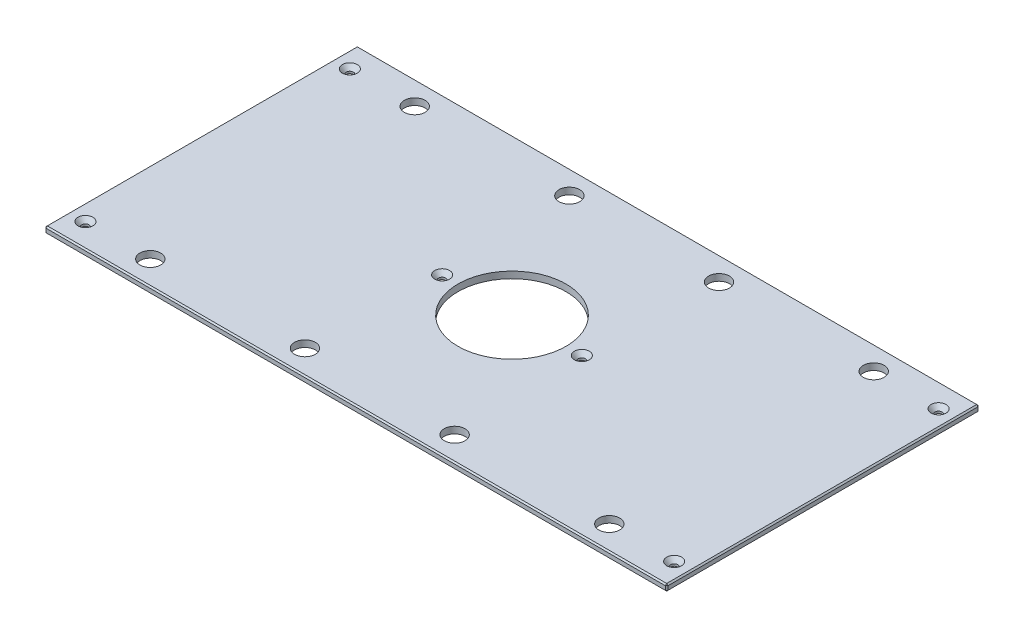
ISO-10303-21;
HEADER;
FILE_DESCRIPTION(('STEP AP214'),'2;1');
FILE_NAME('part.step','',(''),(''),'','','');
FILE_SCHEMA(('AUTOMOTIVE_DESIGN { 1 0 10303 214 1 1 1 1 }'));
ENDSEC;
DATA;
#1=APPLICATION_CONTEXT('core data for automotive mechanical design processes');
#2=APPLICATION_PROTOCOL_DEFINITION('international standard','automotive_design',2000,#1);
#3=PRODUCT_CONTEXT('',#1,'mechanical');
#4=PRODUCT('Part','Part','',(#3));
#5=PRODUCT_RELATED_PRODUCT_CATEGORY('part','',(#4));
#6=PRODUCT_DEFINITION_FORMATION('','',#4);
#7=PRODUCT_DEFINITION_CONTEXT('part definition',#1,'design');
#8=PRODUCT_DEFINITION('design','',#6,#7);
#9=PRODUCT_DEFINITION_SHAPE('','',#8);
#10=(LENGTH_UNIT() NAMED_UNIT(*) SI_UNIT(.MILLI.,.METRE.));
#11=(NAMED_UNIT(*) PLANE_ANGLE_UNIT() SI_UNIT($,.RADIAN.));
#12=(NAMED_UNIT(*) SI_UNIT($,.STERADIAN.) SOLID_ANGLE_UNIT());
#13=UNCERTAINTY_MEASURE_WITH_UNIT(LENGTH_MEASURE(1.E-05),#10,'distance_accuracy_value','');
#14=(GEOMETRIC_REPRESENTATION_CONTEXT(3) GLOBAL_UNCERTAINTY_ASSIGNED_CONTEXT((#13)) GLOBAL_UNIT_ASSIGNED_CONTEXT((#10,
#11,#12)) REPRESENTATION_CONTEXT('',''));
#15=CARTESIAN_POINT('',(0.,0.,0.));
#16=DIRECTION('',(0.,0.,1.));
#17=DIRECTION('',(1.,0.,0.));
#18=AXIS2_PLACEMENT_3D('',#15,#16,#17);
#19=CARTESIAN_POINT('',(-296.8625,6.35,-149.225));
#20=DIRECTION('',(1.,0.,0.));
#21=DIRECTION('',(0.,0.,-1.));
#22=AXIS2_PLACEMENT_3D('',#19,#20,#21);
#23=PLANE('',#22);
#24=DIRECTION('',(0.,0.,-1.));
#25=VECTOR('',#24,1.);
#26=CARTESIAN_POINT('',(-296.8625,5.07999999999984,-149.225));
#27=LINE('',#26,#25);
#28=CARTESIAN_POINT('',(-296.8625,5.07999999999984,147.955));
#29=VERTEX_POINT('',#28);
#30=CARTESIAN_POINT('',(-296.8625,5.07999999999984,-147.955));
#31=VERTEX_POINT('',#30);
#32=EDGE_CURVE('E140',#29,#31,#27,.T.);
#33=ORIENTED_EDGE('',*,*,#32,.T.);
#34=DIRECTION('',(0.,-1.,0.));
#35=VECTOR('',#34,1.);
#36=CARTESIAN_POINT('',(-296.8625,6.35,-147.955));
#37=LINE('',#36,#35);
#38=CARTESIAN_POINT('',(-296.8625,1.27000000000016,-147.955));
#39=VERTEX_POINT('',#38);
#40=EDGE_CURVE('E135',#31,#39,#37,.T.);
#41=ORIENTED_EDGE('',*,*,#40,.T.);
#42=DIRECTION('',(0.,0.,1.));
#43=VECTOR('',#42,1.);
#44=CARTESIAN_POINT('',(-296.8625,1.27000000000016,-149.225));
#45=LINE('',#44,#43);
#46=CARTESIAN_POINT('',(-296.8625,1.27000000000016,147.955));
#47=VERTEX_POINT('',#46);
#48=EDGE_CURVE('E130',#39,#47,#45,.T.);
#49=ORIENTED_EDGE('',*,*,#48,.T.);
#50=DIRECTION('',(0.,1.,0.));
#51=VECTOR('',#50,1.);
#52=CARTESIAN_POINT('',(-296.8625,6.35,147.955));
#53=LINE('',#52,#51);
#54=EDGE_CURVE('E132',#47,#29,#53,.T.);
#55=ORIENTED_EDGE('',*,*,#54,.T.);
#56=EDGE_LOOP('',(#33,#41,#49,#55));
#57=FACE_BOUND('',#56,.T.);
#58=ADVANCED_FACE('F38',(#57),#23,.F.);
#59=CARTESIAN_POINT('',(-296.8625,6.35,149.225));
#60=DIRECTION('',(0.,0.,-1.));
#61=DIRECTION('',(-1.,0.,0.));
#62=AXIS2_PLACEMENT_3D('',#59,#60,#61);
#63=PLANE('',#62);
#64=DIRECTION('',(1.,0.,0.));
#65=VECTOR('',#64,1.);
#66=CARTESIAN_POINT('',(-296.8625,1.27000000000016,149.225));
#67=LINE('',#66,#65);
#68=CARTESIAN_POINT('',(-295.5925,1.27000000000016,149.225));
#69=VERTEX_POINT('',#68);
#70=CARTESIAN_POINT('',(295.5925,1.27000000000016,149.225));
#71=VERTEX_POINT('',#70);
#72=EDGE_CURVE('E62',#69,#71,#67,.T.);
#73=ORIENTED_EDGE('',*,*,#72,.T.);
#74=DIRECTION('',(0.,1.,0.));
#75=VECTOR('',#74,1.);
#76=CARTESIAN_POINT('',(295.5925,6.35,149.225));
#77=LINE('',#76,#75);
#78=CARTESIAN_POINT('',(295.5925,5.07999999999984,149.225));
#79=VERTEX_POINT('',#78);
#80=EDGE_CURVE('E11',#71,#79,#77,.T.);
#81=ORIENTED_EDGE('',*,*,#80,.T.);
#82=DIRECTION('',(-1.,0.,0.));
#83=VECTOR('',#82,1.);
#84=CARTESIAN_POINT('',(-296.8625,5.07999999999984,149.225));
#85=LINE('',#84,#83);
#86=CARTESIAN_POINT('',(-295.5925,5.07999999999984,149.225));
#87=VERTEX_POINT('',#86);
#88=EDGE_CURVE('E48',#79,#87,#85,.T.);
#89=ORIENTED_EDGE('',*,*,#88,.T.);
#90=DIRECTION('',(0.,-1.,0.));
#91=VECTOR('',#90,1.);
#92=CARTESIAN_POINT('',(-295.5925,6.35,149.225));
#93=LINE('',#92,#91);
#94=EDGE_CURVE('E365',#87,#69,#93,.T.);
#95=ORIENTED_EDGE('',*,*,#94,.T.);
#96=EDGE_LOOP('',(#73,#81,#89,#95));
#97=FACE_BOUND('',#96,.T.);
#98=ADVANCED_FACE('F444',(#97),#63,.F.);
#99=CARTESIAN_POINT('',(296.8625,6.35,-149.225));
#100=DIRECTION('',(-1.,0.,0.));
#101=DIRECTION('',(0.,0.,1.));
#102=AXIS2_PLACEMENT_3D('',#99,#100,#101);
#103=PLANE('',#102);
#104=DIRECTION('',(0.,0.,-1.));
#105=VECTOR('',#104,1.);
#106=CARTESIAN_POINT('',(296.8625,1.27000000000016,-149.225));
#107=LINE('',#106,#105);
#108=CARTESIAN_POINT('',(296.8625,1.27000000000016,147.955));
#109=VERTEX_POINT('',#108);
#110=CARTESIAN_POINT('',(296.8625,1.27000000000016,-147.955));
#111=VERTEX_POINT('',#110);
#112=EDGE_CURVE('E358',#109,#111,#107,.T.);
#113=ORIENTED_EDGE('',*,*,#112,.T.);
#114=DIRECTION('',(0.,1.,0.));
#115=VECTOR('',#114,1.);
#116=CARTESIAN_POINT('',(296.8625,6.35,-147.955));
#117=LINE('',#116,#115);
#118=CARTESIAN_POINT('',(296.8625,5.07999999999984,-147.955));
#119=VERTEX_POINT('',#118);
#120=EDGE_CURVE('E361',#111,#119,#117,.T.);
#121=ORIENTED_EDGE('',*,*,#120,.T.);
#122=DIRECTION('',(0.,0.,1.));
#123=VECTOR('',#122,1.);
#124=CARTESIAN_POINT('',(296.8625,5.07999999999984,149.225));
#125=LINE('',#124,#123);
#126=CARTESIAN_POINT('',(296.8625,5.07999999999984,147.955));
#127=VERTEX_POINT('',#126);
#128=EDGE_CURVE('E355',#119,#127,#125,.T.);
#129=ORIENTED_EDGE('',*,*,#128,.T.);
#130=DIRECTION('',(0.,-1.,0.));
#131=VECTOR('',#130,1.);
#132=CARTESIAN_POINT('',(296.8625,6.35,147.955));
#133=LINE('',#132,#131);
#134=EDGE_CURVE('E352',#127,#109,#133,.T.);
#135=ORIENTED_EDGE('',*,*,#134,.T.);
#136=EDGE_LOOP('',(#113,#121,#129,#135));
#137=FACE_BOUND('',#136,.T.);
#138=ADVANCED_FACE('F431',(#137),#103,.F.);
#139=CARTESIAN_POINT('',(-296.8625,6.35,-149.225));
#140=DIRECTION('',(0.,0.,1.));
#141=DIRECTION('',(1.,0.,0.));
#142=AXIS2_PLACEMENT_3D('',#139,#140,#141);
#143=PLANE('',#142);
#144=DIRECTION('',(-1.,0.,0.));
#145=VECTOR('',#144,1.);
#146=CARTESIAN_POINT('',(-296.8625,1.27000000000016,-149.225));
#147=LINE('',#146,#145);
#148=CARTESIAN_POINT('',(295.5925,1.27000000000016,-149.225));
#149=VERTEX_POINT('',#148);
#150=CARTESIAN_POINT('',(-295.5925,1.27000000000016,-149.225));
#151=VERTEX_POINT('',#150);
#152=EDGE_CURVE('E318',#149,#151,#147,.T.);
#153=ORIENTED_EDGE('',*,*,#152,.T.);
#154=DIRECTION('',(0.,1.,0.));
#155=VECTOR('',#154,1.);
#156=CARTESIAN_POINT('',(-295.5925,6.35,-149.225));
#157=LINE('',#156,#155);
#158=CARTESIAN_POINT('',(-295.5925,5.07999999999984,-149.225));
#159=VERTEX_POINT('',#158);
#160=EDGE_CURVE('E323',#151,#159,#157,.T.);
#161=ORIENTED_EDGE('',*,*,#160,.T.);
#162=DIRECTION('',(1.,0.,0.));
#163=VECTOR('',#162,1.);
#164=CARTESIAN_POINT('',(296.8625,5.07999999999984,-149.225));
#165=LINE('',#164,#163);
#166=CARTESIAN_POINT('',(295.5925,5.07999999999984,-149.225));
#167=VERTEX_POINT('',#166);
#168=EDGE_CURVE('E320',#159,#167,#165,.T.);
#169=ORIENTED_EDGE('',*,*,#168,.T.);
#170=DIRECTION('',(0.,-1.,0.));
#171=VECTOR('',#170,1.);
#172=CARTESIAN_POINT('',(295.5925,6.35,-149.225));
#173=LINE('',#172,#171);
#174=EDGE_CURVE('E315',#167,#149,#173,.T.);
#175=ORIENTED_EDGE('',*,*,#174,.T.);
#176=EDGE_LOOP('',(#153,#161,#169,#175));
#177=FACE_BOUND('',#176,.T.);
#178=ADVANCED_FACE('F405',(#177),#143,.F.);
#179=CARTESIAN_POINT('',(0.,6.35,0.));
#180=DIRECTION('',(0.,1.,0.));
#181=DIRECTION('',(0.,0.,1.));
#182=AXIS2_PLACEMENT_3D('',#179,#180,#181);
#183=PLANE('',#182);
#184=CARTESIAN_POINT('',(280.9875,6.35,-126.20498));
#185=DIRECTION('',(0.,1.,0.));
#186=DIRECTION('',(0.,0.,1.));
#187=AXIS2_PLACEMENT_3D('',#184,#185,#186);
#188=CIRCLE('',#187,7.13740000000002);
#189=CARTESIAN_POINT('',(280.9875,6.35,-119.06758));
#190=VERTEX_POINT('',#189);
#191=EDGE_CURVE('E976',#190,#190,#188,.T.);
#192=ORIENTED_EDGE('',*,*,#191,.F.);
#193=EDGE_LOOP('',(#192));
#194=FACE_BOUND('',#193,.T.);
#195=CARTESIAN_POINT('',(280.9875,6.35,126.20498));
#196=DIRECTION('',(0.,1.,0.));
#197=DIRECTION('',(0.,0.,1.));
#198=AXIS2_PLACEMENT_3D('',#195,#196,#197);
#199=CIRCLE('',#198,7.13740000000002);
#200=CARTESIAN_POINT('',(280.9875,6.35,133.34238));
#201=VERTEX_POINT('',#200);
#202=EDGE_CURVE('E980',#201,#201,#199,.T.);
#203=ORIENTED_EDGE('',*,*,#202,.F.);
#204=EDGE_LOOP('',(#203));
#205=FACE_BOUND('',#204,.T.);
#206=CARTESIAN_POINT('',(-280.9875,6.35,126.20498));
#207=DIRECTION('',(0.,1.,0.));
#208=DIRECTION('',(0.,0.,1.));
#209=AXIS2_PLACEMENT_3D('',#206,#207,#208);
#210=CIRCLE('',#209,7.13740000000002);
#211=CARTESIAN_POINT('',(-280.9875,6.35,133.34238));
#212=VERTEX_POINT('',#211);
#213=EDGE_CURVE('E984',#212,#212,#210,.T.);
#214=ORIENTED_EDGE('',*,*,#213,.F.);
#215=EDGE_LOOP('',(#214));
#216=FACE_BOUND('',#215,.T.);
#217=CARTESIAN_POINT('',(-66.675,6.35,0.));
#218=DIRECTION('',(0.,1.,0.));
#219=DIRECTION('',(0.,0.,1.));
#220=AXIS2_PLACEMENT_3D('',#217,#218,#219);
#221=CIRCLE('',#220,7.1374);
#222=CARTESIAN_POINT('',(-66.675,6.35,7.1374));
#223=VERTEX_POINT('',#222);
#224=EDGE_CURVE('E988',#223,#223,#221,.T.);
#225=ORIENTED_EDGE('',*,*,#224,.F.);
#226=EDGE_LOOP('',(#225));
#227=FACE_BOUND('',#226,.T.);
#228=CARTESIAN_POINT('',(66.675,6.35,0.));
#229=DIRECTION('',(0.,1.,0.));
#230=DIRECTION('',(0.,0.,1.));
#231=AXIS2_PLACEMENT_3D('',#228,#229,#230);
#232=CIRCLE('',#231,7.1374);
#233=CARTESIAN_POINT('',(66.675,6.35,7.1374));
#234=VERTEX_POINT('',#233);
#235=EDGE_CURVE('E992',#234,#234,#232,.T.);
#236=ORIENTED_EDGE('',*,*,#235,.F.);
#237=EDGE_LOOP('',(#236));
#238=FACE_BOUND('',#237,.T.);
#239=CARTESIAN_POINT('',(-280.9875,6.35,-126.20498));
#240=DIRECTION('',(0.,1.,0.));
#241=DIRECTION('',(0.,0.,1.));
#242=AXIS2_PLACEMENT_3D('',#239,#240,#241);
#243=CIRCLE('',#242,7.13740000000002);
#244=CARTESIAN_POINT('',(-280.9875,6.35,-119.06758));
#245=VERTEX_POINT('',#244);
#246=EDGE_CURVE('E995',#245,#245,#243,.T.);
#247=ORIENTED_EDGE('',*,*,#246,.F.);
#248=EDGE_LOOP('',(#247));
#249=FACE_BOUND('',#248,.T.);
#250=DIRECTION('',(0.,0.,-1.));
#251=VECTOR('',#250,1.);
#252=CARTESIAN_POINT('',(295.5925,6.35,-149.225));
#253=LINE('',#252,#251);
#254=CARTESIAN_POINT('',(295.5925,6.35,147.955));
#255=VERTEX_POINT('',#254);
#256=CARTESIAN_POINT('',(295.5925,6.35,-147.955));
#257=VERTEX_POINT('',#256);
#258=EDGE_CURVE('E333',#255,#257,#253,.T.);
#259=ORIENTED_EDGE('',*,*,#258,.T.);
#260=DIRECTION('',(-1.,0.,0.));
#261=VECTOR('',#260,1.);
#262=CARTESIAN_POINT('',(-296.8625,6.35,-147.955));
#263=LINE('',#262,#261);
#264=CARTESIAN_POINT('',(-295.5925,6.35,-147.955));
#265=VERTEX_POINT('',#264);
#266=EDGE_CURVE('E336',#257,#265,#263,.T.);
#267=ORIENTED_EDGE('',*,*,#266,.T.);
#268=DIRECTION('',(0.,0.,1.));
#269=VECTOR('',#268,1.);
#270=CARTESIAN_POINT('',(-295.5925,6.35,149.225));
#271=LINE('',#270,#269);
#272=CARTESIAN_POINT('',(-295.5925,6.35,147.955));
#273=VERTEX_POINT('',#272);
#274=EDGE_CURVE('E330',#265,#273,#271,.T.);
#275=ORIENTED_EDGE('',*,*,#274,.T.);
#276=DIRECTION('',(1.,0.,0.));
#277=VECTOR('',#276,1.);
#278=CARTESIAN_POINT('',(296.8625,6.35,147.955));
#279=LINE('',#278,#277);
#280=EDGE_CURVE('E327',#273,#255,#279,.T.);
#281=ORIENTED_EDGE('',*,*,#280,.T.);
#282=EDGE_LOOP('',(#259,#267,#275,#281));
#283=FACE_BOUND('',#282,.T.);
#284=CARTESIAN_POINT('',(219.075,6.35,-126.20498));
#285=DIRECTION('',(0.,1.,0.));
#286=DIRECTION('',(0.,0.,1.));
#287=AXIS2_PLACEMENT_3D('',#284,#285,#286);
#288=CIRCLE('',#287,9.921875);
#289=CARTESIAN_POINT('',(219.075,6.35,-116.283105));
#290=VERTEX_POINT('',#289);
#291=EDGE_CURVE('E230',#290,#290,#288,.T.);
#292=ORIENTED_EDGE('',*,*,#291,.F.);
#293=EDGE_LOOP('',(#292));
#294=FACE_BOUND('',#293,.T.);
#295=CARTESIAN_POINT('',(-219.075,6.35,-126.20498));
#296=DIRECTION('',(0.,1.,0.));
#297=DIRECTION('',(0.,0.,1.));
#298=AXIS2_PLACEMENT_3D('',#295,#296,#297);
#299=CIRCLE('',#298,9.921875);
#300=CARTESIAN_POINT('',(-219.075,6.35,-116.283105));
#301=VERTEX_POINT('',#300);
#302=EDGE_CURVE('E245',#301,#301,#299,.T.);
#303=ORIENTED_EDGE('',*,*,#302,.F.);
#304=EDGE_LOOP('',(#303));
#305=FACE_BOUND('',#304,.T.);
#306=CARTESIAN_POINT('',(219.075,6.35,126.20498));
#307=DIRECTION('',(0.,1.,0.));
#308=DIRECTION('',(0.,0.,1.));
#309=AXIS2_PLACEMENT_3D('',#306,#307,#308);
#310=CIRCLE('',#309,9.921875);
#311=CARTESIAN_POINT('',(219.075,6.35,136.126855));
#312=VERTEX_POINT('',#311);
#313=EDGE_CURVE('E257',#312,#312,#310,.T.);
#314=ORIENTED_EDGE('',*,*,#313,.F.);
#315=EDGE_LOOP('',(#314));
#316=FACE_BOUND('',#315,.T.);
#317=CARTESIAN_POINT('',(-219.075,6.35,126.20498));
#318=DIRECTION('',(0.,1.,0.));
#319=DIRECTION('',(0.,0.,1.));
#320=AXIS2_PLACEMENT_3D('',#317,#318,#319);
#321=CIRCLE('',#320,9.921875);
#322=CARTESIAN_POINT('',(-219.075,6.35,136.126855));
#323=VERTEX_POINT('',#322);
#324=EDGE_CURVE('E265',#323,#323,#321,.T.);
#325=ORIENTED_EDGE('',*,*,#324,.F.);
#326=EDGE_LOOP('',(#325));
#327=FACE_BOUND('',#326,.T.);
#328=CARTESIAN_POINT('',(-71.4375,6.35,-126.20498));
#329=DIRECTION('',(0.,1.,0.));
#330=DIRECTION('',(0.,0.,1.));
#331=AXIS2_PLACEMENT_3D('',#328,#329,#330);
#332=CIRCLE('',#331,9.921875);
#333=CARTESIAN_POINT('',(-71.4375,6.35,-116.283105));
#334=VERTEX_POINT('',#333);
#335=EDGE_CURVE('E273',#334,#334,#332,.T.);
#336=ORIENTED_EDGE('',*,*,#335,.F.);
#337=EDGE_LOOP('',(#336));
#338=FACE_BOUND('',#337,.T.);
#339=CARTESIAN_POINT('',(71.4375,6.35,-126.20498));
#340=DIRECTION('',(0.,1.,0.));
#341=DIRECTION('',(0.,0.,1.));
#342=AXIS2_PLACEMENT_3D('',#339,#340,#341);
#343=CIRCLE('',#342,9.921875);
#344=CARTESIAN_POINT('',(71.4375,6.35,-116.283105));
#345=VERTEX_POINT('',#344);
#346=EDGE_CURVE('E281',#345,#345,#343,.T.);
#347=ORIENTED_EDGE('',*,*,#346,.F.);
#348=EDGE_LOOP('',(#347));
#349=FACE_BOUND('',#348,.T.);
#350=CARTESIAN_POINT('',(71.4375,6.35,126.20498));
#351=DIRECTION('',(0.,1.,0.));
#352=DIRECTION('',(0.,0.,1.));
#353=AXIS2_PLACEMENT_3D('',#350,#351,#352);
#354=CIRCLE('',#353,9.921875);
#355=CARTESIAN_POINT('',(71.4375,6.35,136.126855));
#356=VERTEX_POINT('',#355);
#357=EDGE_CURVE('E288',#356,#356,#354,.T.);
#358=ORIENTED_EDGE('',*,*,#357,.F.);
#359=EDGE_LOOP('',(#358));
#360=FACE_BOUND('',#359,.T.);
#361=CARTESIAN_POINT('',(-71.4375,6.35,126.20498));
#362=DIRECTION('',(0.,1.,0.));
#363=DIRECTION('',(0.,0.,1.));
#364=AXIS2_PLACEMENT_3D('',#361,#362,#363);
#365=CIRCLE('',#364,9.921875);
#366=CARTESIAN_POINT('',(-71.4375,6.35,136.126855));
#367=VERTEX_POINT('',#366);
#368=EDGE_CURVE('E296',#367,#367,#365,.T.);
#369=ORIENTED_EDGE('',*,*,#368,.F.);
#370=EDGE_LOOP('',(#369));
#371=FACE_BOUND('',#370,.T.);
#372=CARTESIAN_POINT('',(0.,6.35,0.));
#373=DIRECTION('',(0.,1.,0.));
#374=DIRECTION('',(0.,0.,1.));
#375=AXIS2_PLACEMENT_3D('',#372,#373,#374);
#376=CIRCLE('',#375,51.562);
#377=CARTESIAN_POINT('',(0.,6.35,51.562));
#378=VERTEX_POINT('',#377);
#379=EDGE_CURVE('E304',#378,#378,#376,.T.);
#380=ORIENTED_EDGE('',*,*,#379,.F.);
#381=EDGE_LOOP('',(#380));
#382=FACE_BOUND('',#381,.T.);
#383=ADVANCED_FACE('F453',(#194,#205,#216,#227,#238,#249,#283,#294,#305,#316,#327,#338,#349,
#360,#371,#382),#183,.T.);
#384=CARTESIAN_POINT('',(0.,0.,0.));
#385=DIRECTION('',(0.,1.,0.));
#386=DIRECTION('',(0.,0.,1.));
#387=AXIS2_PLACEMENT_3D('',#384,#385,#386);
#388=PLANE('',#387);
#389=CARTESIAN_POINT('',(280.9875,0.,-126.20498));
#390=DIRECTION('',(0.,1.,0.));
#391=DIRECTION('',(0.,0.,1.));
#392=AXIS2_PLACEMENT_3D('',#389,#390,#391);
#393=CIRCLE('',#392,3.3782);
#394=CARTESIAN_POINT('',(280.9875,0.,-122.82678));
#395=VERTEX_POINT('',#394);
#396=EDGE_CURVE('E1042',#395,#395,#393,.T.);
#397=ORIENTED_EDGE('',*,*,#396,.T.);
#398=EDGE_LOOP('',(#397));
#399=FACE_BOUND('',#398,.T.);
#400=CARTESIAN_POINT('',(280.9875,0.,126.20498));
#401=DIRECTION('',(0.,1.,0.));
#402=DIRECTION('',(0.,0.,1.));
#403=AXIS2_PLACEMENT_3D('',#400,#401,#402);
#404=CIRCLE('',#403,3.3782);
#405=CARTESIAN_POINT('',(280.9875,0.,129.58318));
#406=VERTEX_POINT('',#405);
#407=EDGE_CURVE('E1032',#406,#406,#404,.T.);
#408=ORIENTED_EDGE('',*,*,#407,.T.);
#409=EDGE_LOOP('',(#408));
#410=FACE_BOUND('',#409,.T.);
#411=CARTESIAN_POINT('',(-280.9875,0.,126.20498));
#412=DIRECTION('',(0.,1.,0.));
#413=DIRECTION('',(0.,0.,1.));
#414=AXIS2_PLACEMENT_3D('',#411,#412,#413);
#415=CIRCLE('',#414,3.3782);
#416=CARTESIAN_POINT('',(-280.9875,0.,129.58318));
#417=VERTEX_POINT('',#416);
#418=EDGE_CURVE('E1022',#417,#417,#415,.T.);
#419=ORIENTED_EDGE('',*,*,#418,.T.);
#420=EDGE_LOOP('',(#419));
#421=FACE_BOUND('',#420,.T.);
#422=CARTESIAN_POINT('',(-66.675,0.,0.));
#423=DIRECTION('',(0.,1.,0.));
#424=DIRECTION('',(0.,0.,1.));
#425=AXIS2_PLACEMENT_3D('',#422,#423,#424);
#426=CIRCLE('',#425,3.3782);
#427=CARTESIAN_POINT('',(-66.675,0.,3.3782));
#428=VERTEX_POINT('',#427);
#429=EDGE_CURVE('E1012',#428,#428,#426,.T.);
#430=ORIENTED_EDGE('',*,*,#429,.T.);
#431=EDGE_LOOP('',(#430));
#432=FACE_BOUND('',#431,.T.);
#433=CARTESIAN_POINT('',(66.675,0.,0.));
#434=DIRECTION('',(0.,1.,0.));
#435=DIRECTION('',(0.,0.,1.));
#436=AXIS2_PLACEMENT_3D('',#433,#434,#435);
#437=CIRCLE('',#436,3.3782);
#438=CARTESIAN_POINT('',(66.675,0.,3.3782));
#439=VERTEX_POINT('',#438);
#440=EDGE_CURVE('E998',#439,#439,#437,.T.);
#441=ORIENTED_EDGE('',*,*,#440,.T.);
#442=EDGE_LOOP('',(#441));
#443=FACE_BOUND('',#442,.T.);
#444=CARTESIAN_POINT('',(-280.9875,0.,-126.20498));
#445=DIRECTION('',(0.,1.,0.));
#446=DIRECTION('',(0.,0.,1.));
#447=AXIS2_PLACEMENT_3D('',#444,#445,#446);
#448=CIRCLE('',#447,3.3782);
#449=CARTESIAN_POINT('',(-280.9875,0.,-122.82678));
#450=VERTEX_POINT('',#449);
#451=EDGE_CURVE('E248',#450,#450,#448,.T.);
#452=ORIENTED_EDGE('',*,*,#451,.T.);
#453=EDGE_LOOP('',(#452));
#454=FACE_BOUND('',#453,.T.);
#455=DIRECTION('',(0.,0.,-1.));
#456=VECTOR('',#455,1.);
#457=CARTESIAN_POINT('',(-295.5925,0.,0.));
#458=LINE('',#457,#456);
#459=CARTESIAN_POINT('',(-295.5925,0.,147.955));
#460=VERTEX_POINT('',#459);
#461=CARTESIAN_POINT('',(-295.5925,0.,-147.955));
#462=VERTEX_POINT('',#461);
#463=EDGE_CURVE('E165',#460,#462,#458,.T.);
#464=ORIENTED_EDGE('',*,*,#463,.T.);
#465=DIRECTION('',(1.,0.,0.));
#466=VECTOR('',#465,1.);
#467=CARTESIAN_POINT('',(0.,0.,-147.955));
#468=LINE('',#467,#466);
#469=CARTESIAN_POINT('',(295.5925,0.,-147.955));
#470=VERTEX_POINT('',#469);
#471=EDGE_CURVE('E348',#462,#470,#468,.T.);
#472=ORIENTED_EDGE('',*,*,#471,.T.);
#473=DIRECTION('',(0.,0.,1.));
#474=VECTOR('',#473,1.);
#475=CARTESIAN_POINT('',(295.5925,0.,0.));
#476=LINE('',#475,#474);
#477=CARTESIAN_POINT('',(295.5925,0.,147.955));
#478=VERTEX_POINT('',#477);
#479=EDGE_CURVE('E345',#470,#478,#476,.T.);
#480=ORIENTED_EDGE('',*,*,#479,.T.);
#481=DIRECTION('',(-1.,0.,0.));
#482=VECTOR('',#481,1.);
#483=CARTESIAN_POINT('',(0.,0.,147.955));
#484=LINE('',#483,#482);
#485=EDGE_CURVE('E340',#478,#460,#484,.T.);
#486=ORIENTED_EDGE('',*,*,#485,.T.);
#487=EDGE_LOOP('',(#464,#472,#480,#486));
#488=FACE_BOUND('',#487,.T.);
#489=CARTESIAN_POINT('',(219.075,0.,-126.20498));
#490=DIRECTION('',(0.,1.,0.));
#491=DIRECTION('',(0.,0.,1.));
#492=AXIS2_PLACEMENT_3D('',#489,#490,#491);
#493=CIRCLE('',#492,9.921875);
#494=CARTESIAN_POINT('',(219.075,0.,-116.283105));
#495=VERTEX_POINT('',#494);
#496=EDGE_CURVE('E237',#495,#495,#493,.T.);
#497=ORIENTED_EDGE('',*,*,#496,.T.);
#498=EDGE_LOOP('',(#497));
#499=FACE_BOUND('',#498,.T.);
#500=CARTESIAN_POINT('',(-219.075,0.,-126.20498));
#501=DIRECTION('',(0.,1.,0.));
#502=DIRECTION('',(0.,0.,1.));
#503=AXIS2_PLACEMENT_3D('',#500,#501,#502);
#504=CIRCLE('',#503,9.921875);
#505=CARTESIAN_POINT('',(-219.075,0.,-116.283105));
#506=VERTEX_POINT('',#505);
#507=EDGE_CURVE('E254',#506,#506,#504,.T.);
#508=ORIENTED_EDGE('',*,*,#507,.T.);
#509=EDGE_LOOP('',(#508));
#510=FACE_BOUND('',#509,.T.);
#511=CARTESIAN_POINT('',(219.075,0.,126.20498));
#512=DIRECTION('',(0.,1.,0.));
#513=DIRECTION('',(0.,0.,1.));
#514=AXIS2_PLACEMENT_3D('',#511,#512,#513);
#515=CIRCLE('',#514,9.921875);
#516=CARTESIAN_POINT('',(219.075,0.,136.126855));
#517=VERTEX_POINT('',#516);
#518=EDGE_CURVE('E261',#517,#517,#515,.T.);
#519=ORIENTED_EDGE('',*,*,#518,.T.);
#520=EDGE_LOOP('',(#519));
#521=FACE_BOUND('',#520,.T.);
#522=CARTESIAN_POINT('',(-219.075,0.,126.20498));
#523=DIRECTION('',(0.,1.,0.));
#524=DIRECTION('',(0.,0.,1.));
#525=AXIS2_PLACEMENT_3D('',#522,#523,#524);
#526=CIRCLE('',#525,9.921875);
#527=CARTESIAN_POINT('',(-219.075,0.,136.126855));
#528=VERTEX_POINT('',#527);
#529=EDGE_CURVE('E269',#528,#528,#526,.T.);
#530=ORIENTED_EDGE('',*,*,#529,.T.);
#531=EDGE_LOOP('',(#530));
#532=FACE_BOUND('',#531,.T.);
#533=CARTESIAN_POINT('',(-71.4375,0.,-126.20498));
#534=DIRECTION('',(0.,1.,0.));
#535=DIRECTION('',(0.,0.,1.));
#536=AXIS2_PLACEMENT_3D('',#533,#534,#535);
#537=CIRCLE('',#536,9.921875);
#538=CARTESIAN_POINT('',(-71.4375,0.,-116.283105));
#539=VERTEX_POINT('',#538);
#540=EDGE_CURVE('E277',#539,#539,#537,.T.);
#541=ORIENTED_EDGE('',*,*,#540,.T.);
#542=EDGE_LOOP('',(#541));
#543=FACE_BOUND('',#542,.T.);
#544=CARTESIAN_POINT('',(71.4375,0.,-126.20498));
#545=DIRECTION('',(0.,1.,0.));
#546=DIRECTION('',(0.,0.,1.));
#547=AXIS2_PLACEMENT_3D('',#544,#545,#546);
#548=CIRCLE('',#547,9.921875);
#549=CARTESIAN_POINT('',(71.4375,0.,-116.283105));
#550=VERTEX_POINT('',#549);
#551=EDGE_CURVE('E284',#550,#550,#548,.T.);
#552=ORIENTED_EDGE('',*,*,#551,.T.);
#553=EDGE_LOOP('',(#552));
#554=FACE_BOUND('',#553,.T.);
#555=CARTESIAN_POINT('',(71.4375,0.,126.20498));
#556=DIRECTION('',(0.,1.,0.));
#557=DIRECTION('',(0.,0.,1.));
#558=AXIS2_PLACEMENT_3D('',#555,#556,#557);
#559=CIRCLE('',#558,9.921875);
#560=CARTESIAN_POINT('',(71.4375,0.,136.126855));
#561=VERTEX_POINT('',#560);
#562=EDGE_CURVE('E292',#561,#561,#559,.T.);
#563=ORIENTED_EDGE('',*,*,#562,.T.);
#564=EDGE_LOOP('',(#563));
#565=FACE_BOUND('',#564,.T.);
#566=CARTESIAN_POINT('',(-71.4375,0.,126.20498));
#567=DIRECTION('',(0.,1.,0.));
#568=DIRECTION('',(0.,0.,1.));
#569=AXIS2_PLACEMENT_3D('',#566,#567,#568);
#570=CIRCLE('',#569,9.921875);
#571=CARTESIAN_POINT('',(-71.4375,0.,136.126855));
#572=VERTEX_POINT('',#571);
#573=EDGE_CURVE('E300',#572,#572,#570,.T.);
#574=ORIENTED_EDGE('',*,*,#573,.T.);
#575=EDGE_LOOP('',(#574));
#576=FACE_BOUND('',#575,.T.);
#577=CARTESIAN_POINT('',(0.,0.,0.));
#578=DIRECTION('',(0.,1.,0.));
#579=DIRECTION('',(0.,0.,1.));
#580=AXIS2_PLACEMENT_3D('',#577,#578,#579);
#581=CIRCLE('',#580,51.562);
#582=CARTESIAN_POINT('',(0.,0.,51.562));
#583=VERTEX_POINT('',#582);
#584=EDGE_CURVE('E153',#583,#583,#581,.T.);
#585=ORIENTED_EDGE('',*,*,#584,.T.);
#586=EDGE_LOOP('',(#585));
#587=FACE_BOUND('',#586,.T.);
#588=ADVANCED_FACE('F418',(#399,#410,#421,#432,#443,#454,#488,#499,#510,#521,#532,#543,#554,
#565,#576,#587),#388,.F.);
#589=CARTESIAN_POINT('',(0.,0.,0.));
#590=DIRECTION('',(0.,1.,0.));
#591=DIRECTION('',(0.,0.,1.));
#592=AXIS2_PLACEMENT_3D('',#589,#590,#591);
#593=CYLINDRICAL_SURFACE('',#592,51.562);
#594=ORIENTED_EDGE('',*,*,#584,.F.);
#595=EDGE_LOOP('',(#594));
#596=FACE_BOUND('',#595,.T.);
#597=ORIENTED_EDGE('',*,*,#379,.T.);
#598=EDGE_LOOP('',(#597));
#599=FACE_BOUND('',#598,.T.);
#600=ADVANCED_FACE('F699',(#596,#599),#593,.F.);
#601=CARTESIAN_POINT('',(-71.4375,6.35,126.20498));
#602=DIRECTION('',(0.,1.,0.));
#603=DIRECTION('',(0.,0.,1.));
#604=AXIS2_PLACEMENT_3D('',#601,#602,#603);
#605=CYLINDRICAL_SURFACE('',#604,9.921875);
#606=ORIENTED_EDGE('',*,*,#573,.F.);
#607=EDGE_LOOP('',(#606));
#608=FACE_BOUND('',#607,.T.);
#609=ORIENTED_EDGE('',*,*,#368,.T.);
#610=EDGE_LOOP('',(#609));
#611=FACE_BOUND('',#610,.T.);
#612=ADVANCED_FACE('F893',(#608,#611),#605,.F.);
#613=CARTESIAN_POINT('',(71.4375,6.35,126.20498));
#614=DIRECTION('',(0.,1.,0.));
#615=DIRECTION('',(0.,0.,1.));
#616=AXIS2_PLACEMENT_3D('',#613,#614,#615);
#617=CYLINDRICAL_SURFACE('',#616,9.921875);
#618=ORIENTED_EDGE('',*,*,#562,.F.);
#619=EDGE_LOOP('',(#618));
#620=FACE_BOUND('',#619,.T.);
#621=ORIENTED_EDGE('',*,*,#357,.T.);
#622=EDGE_LOOP('',(#621));
#623=FACE_BOUND('',#622,.T.);
#624=ADVANCED_FACE('F883',(#620,#623),#617,.F.);
#625=CARTESIAN_POINT('',(71.4375,6.35,-126.20498));
#626=DIRECTION('',(0.,1.,0.));
#627=DIRECTION('',(0.,0.,1.));
#628=AXIS2_PLACEMENT_3D('',#625,#626,#627);
#629=CYLINDRICAL_SURFACE('',#628,9.921875);
#630=ORIENTED_EDGE('',*,*,#551,.F.);
#631=EDGE_LOOP('',(#630));
#632=FACE_BOUND('',#631,.T.);
#633=ORIENTED_EDGE('',*,*,#346,.T.);
#634=EDGE_LOOP('',(#633));
#635=FACE_BOUND('',#634,.T.);
#636=ADVANCED_FACE('F873',(#632,#635),#629,.F.);
#637=CARTESIAN_POINT('',(-71.4375,6.35,-126.20498));
#638=DIRECTION('',(0.,1.,0.));
#639=DIRECTION('',(0.,0.,1.));
#640=AXIS2_PLACEMENT_3D('',#637,#638,#639);
#641=CYLINDRICAL_SURFACE('',#640,9.921875);
#642=ORIENTED_EDGE('',*,*,#540,.F.);
#643=EDGE_LOOP('',(#642));
#644=FACE_BOUND('',#643,.T.);
#645=ORIENTED_EDGE('',*,*,#335,.T.);
#646=EDGE_LOOP('',(#645));
#647=FACE_BOUND('',#646,.T.);
#648=ADVANCED_FACE('F863',(#644,#647),#641,.F.);
#649=CARTESIAN_POINT('',(-219.075,6.35,126.20498));
#650=DIRECTION('',(0.,1.,0.));
#651=DIRECTION('',(0.,0.,1.));
#652=AXIS2_PLACEMENT_3D('',#649,#650,#651);
#653=CYLINDRICAL_SURFACE('',#652,9.921875);
#654=ORIENTED_EDGE('',*,*,#529,.F.);
#655=EDGE_LOOP('',(#654));
#656=FACE_BOUND('',#655,.T.);
#657=ORIENTED_EDGE('',*,*,#324,.T.);
#658=EDGE_LOOP('',(#657));
#659=FACE_BOUND('',#658,.T.);
#660=ADVANCED_FACE('F853',(#656,#659),#653,.F.);
#661=CARTESIAN_POINT('',(219.075,6.35,126.20498));
#662=DIRECTION('',(0.,1.,0.));
#663=DIRECTION('',(0.,0.,1.));
#664=AXIS2_PLACEMENT_3D('',#661,#662,#663);
#665=CYLINDRICAL_SURFACE('',#664,9.921875);
#666=ORIENTED_EDGE('',*,*,#518,.F.);
#667=EDGE_LOOP('',(#666));
#668=FACE_BOUND('',#667,.T.);
#669=ORIENTED_EDGE('',*,*,#313,.T.);
#670=EDGE_LOOP('',(#669));
#671=FACE_BOUND('',#670,.T.);
#672=ADVANCED_FACE('F843',(#668,#671),#665,.F.);
#673=CARTESIAN_POINT('',(-219.075,6.35,-126.20498));
#674=DIRECTION('',(0.,1.,0.));
#675=DIRECTION('',(0.,0.,1.));
#676=AXIS2_PLACEMENT_3D('',#673,#674,#675);
#677=CYLINDRICAL_SURFACE('',#676,9.921875);
#678=ORIENTED_EDGE('',*,*,#507,.F.);
#679=EDGE_LOOP('',(#678));
#680=FACE_BOUND('',#679,.T.);
#681=ORIENTED_EDGE('',*,*,#302,.T.);
#682=EDGE_LOOP('',(#681));
#683=FACE_BOUND('',#682,.T.);
#684=ADVANCED_FACE('F833',(#680,#683),#677,.F.);
#685=CARTESIAN_POINT('',(219.075,6.35,-126.20498));
#686=DIRECTION('',(0.,1.,0.));
#687=DIRECTION('',(0.,0.,1.));
#688=AXIS2_PLACEMENT_3D('',#685,#686,#687);
#689=CYLINDRICAL_SURFACE('',#688,9.921875);
#690=ORIENTED_EDGE('',*,*,#496,.F.);
#691=EDGE_LOOP('',(#690));
#692=FACE_BOUND('',#691,.T.);
#693=ORIENTED_EDGE('',*,*,#291,.T.);
#694=EDGE_LOOP('',(#693));
#695=FACE_BOUND('',#694,.T.);
#696=ADVANCED_FACE('F462',(#692,#695),#689,.F.);
#697=CARTESIAN_POINT('',(296.8625,6.35,147.955));
#698=DIRECTION('',(-0.707106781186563,0.,-0.707106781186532));
#699=DIRECTION('',(0.,-1.,0.));
#700=AXIS2_PLACEMENT_3D('',#697,#698,#699);
#701=PLANE('',#700);
#702=DIRECTION('',(-0.707106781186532,0.,0.707106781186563));
#703=VECTOR('',#702,1.);
#704=CARTESIAN_POINT('',(296.8625,5.07999999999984,147.955));
#705=LINE('',#704,#703);
#706=EDGE_CURVE('E42',#79,#127,#705,.F.);
#707=ORIENTED_EDGE('',*,*,#706,.F.);
#708=ORIENTED_EDGE('',*,*,#80,.F.);
#709=DIRECTION('',(0.707106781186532,0.,-0.707106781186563));
#710=VECTOR('',#709,1.);
#711=CARTESIAN_POINT('',(296.2275,1.27000000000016,148.59));
#712=LINE('',#711,#710);
#713=EDGE_CURVE('E219',#109,#71,#712,.F.);
#714=ORIENTED_EDGE('',*,*,#713,.F.);
#715=ORIENTED_EDGE('',*,*,#134,.F.);
#716=EDGE_LOOP('',(#707,#708,#714,#715));
#717=FACE_BOUND('',#716,.T.);
#718=ADVANCED_FACE('F40',(#717),#701,.F.);
#719=CARTESIAN_POINT('',(296.8625,5.07999999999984,147.955));
#720=DIRECTION('',(0.577350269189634,0.577350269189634,0.577350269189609));
#721=DIRECTION('',(-0.707106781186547,0.707106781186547,0.));
#722=AXIS2_PLACEMENT_3D('',#719,#720,#721);
#723=PLANE('',#722);
#724=DIRECTION('',(0.,-0.707106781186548,0.707106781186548));
#725=VECTOR('',#724,1.);
#726=CARTESIAN_POINT('',(295.5925,5.71499999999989,148.59));
#727=LINE('',#726,#725);
#728=EDGE_CURVE('E213',#79,#255,#727,.F.);
#729=ORIENTED_EDGE('',*,*,#728,.F.);
#730=ORIENTED_EDGE('',*,*,#706,.T.);
#731=DIRECTION('',(-0.707106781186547,0.707106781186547,0.));
#732=VECTOR('',#731,1.);
#733=CARTESIAN_POINT('',(296.8625,5.07999999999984,147.955));
#734=LINE('',#733,#732);
#735=EDGE_CURVE('E216',#255,#127,#734,.F.);
#736=ORIENTED_EDGE('',*,*,#735,.F.);
#737=EDGE_LOOP('',(#729,#730,#736));
#738=FACE_BOUND('',#737,.T.);
#739=ADVANCED_FACE('F455',(#738),#723,.T.);
#740=CARTESIAN_POINT('',(295.5925,0.,147.955));
#741=DIRECTION('',(0.577350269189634,-0.577350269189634,0.577350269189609));
#742=DIRECTION('',(0.707106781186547,0.707106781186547,0.));
#743=AXIS2_PLACEMENT_3D('',#740,#741,#742);
#744=PLANE('',#743);
#745=DIRECTION('',(-0.707106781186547,-0.707106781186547,0.));
#746=VECTOR('',#745,1.);
#747=CARTESIAN_POINT('',(295.5925,0.,147.955));
#748=LINE('',#747,#746);
#749=EDGE_CURVE('E205',#109,#478,#748,.T.);
#750=ORIENTED_EDGE('',*,*,#749,.F.);
#751=ORIENTED_EDGE('',*,*,#713,.T.);
#752=DIRECTION('',(0.,0.707106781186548,0.707106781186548));
#753=VECTOR('',#752,1.);
#754=CARTESIAN_POINT('',(295.5925,0.,147.955));
#755=LINE('',#754,#753);
#756=EDGE_CURVE('E209',#478,#71,#755,.T.);
#757=ORIENTED_EDGE('',*,*,#756,.F.);
#758=EDGE_LOOP('',(#750,#751,#757));
#759=FACE_BOUND('',#758,.T.);
#760=ADVANCED_FACE('F424',(#759),#744,.T.);
#761=CARTESIAN_POINT('',(295.5925,6.35,0.));
#762=DIRECTION('',(0.707106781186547,0.707106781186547,0.));
#763=DIRECTION('',(0.,0.,1.));
#764=AXIS2_PLACEMENT_3D('',#761,#762,#763);
#765=PLANE('',#764);
#766=ORIENTED_EDGE('',*,*,#735,.T.);
#767=ORIENTED_EDGE('',*,*,#128,.F.);
#768=DIRECTION('',(0.707106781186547,-0.707106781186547,0.));
#769=VECTOR('',#768,1.);
#770=CARTESIAN_POINT('',(296.2275,5.71499999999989,-147.955));
#771=LINE('',#770,#769);
#772=EDGE_CURVE('E199',#257,#119,#771,.T.);
#773=ORIENTED_EDGE('',*,*,#772,.F.);
#774=ORIENTED_EDGE('',*,*,#258,.F.);
#775=EDGE_LOOP('',(#766,#767,#773,#774));
#776=FACE_BOUND('',#775,.T.);
#777=ADVANCED_FACE('F441',(#776),#765,.T.);
#778=CARTESIAN_POINT('',(0.,6.35,147.955));
#779=DIRECTION('',(0.,0.707106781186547,0.707106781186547));
#780=DIRECTION('',(-1.,0.,0.));
#781=AXIS2_PLACEMENT_3D('',#778,#779,#780);
#782=PLANE('',#781);
#783=ORIENTED_EDGE('',*,*,#728,.T.);
#784=ORIENTED_EDGE('',*,*,#280,.F.);
#785=DIRECTION('',(0.,0.707106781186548,-0.707106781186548));
#786=VECTOR('',#785,1.);
#787=CARTESIAN_POINT('',(-295.5925,6.35,147.955));
#788=LINE('',#787,#786);
#789=EDGE_CURVE('E195',#87,#273,#788,.T.);
#790=ORIENTED_EDGE('',*,*,#789,.F.);
#791=ORIENTED_EDGE('',*,*,#88,.F.);
#792=EDGE_LOOP('',(#783,#784,#790,#791));
#793=FACE_BOUND('',#792,.T.);
#794=ADVANCED_FACE('F446',(#793),#782,.T.);
#795=CARTESIAN_POINT('',(-295.5925,6.35,149.225));
#796=DIRECTION('',(0.707106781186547,0.,-0.707106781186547));
#797=DIRECTION('',(0.,-1.,0.));
#798=AXIS2_PLACEMENT_3D('',#795,#796,#797);
#799=PLANE('',#798);
#800=DIRECTION('',(0.707106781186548,0.,0.707106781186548));
#801=VECTOR('',#800,1.);
#802=CARTESIAN_POINT('',(-296.8625,1.27000000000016,147.955));
#803=LINE('',#802,#801);
#804=EDGE_CURVE('E147',#69,#47,#803,.F.);
#805=ORIENTED_EDGE('',*,*,#804,.F.);
#806=ORIENTED_EDGE('',*,*,#94,.F.);
#807=DIRECTION('',(-0.707106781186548,0.,-0.707106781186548));
#808=VECTOR('',#807,1.);
#809=CARTESIAN_POINT('',(-296.2275,5.07999999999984,148.59));
#810=LINE('',#809,#808);
#811=EDGE_CURVE('E150',#29,#87,#810,.F.);
#812=ORIENTED_EDGE('',*,*,#811,.F.);
#813=ORIENTED_EDGE('',*,*,#54,.F.);
#814=EDGE_LOOP('',(#805,#806,#812,#813));
#815=FACE_BOUND('',#814,.T.);
#816=ADVANCED_FACE('F145',(#815),#799,.F.);
#817=CARTESIAN_POINT('',(-296.8625,1.27000000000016,149.225));
#818=DIRECTION('',(0.,0.707106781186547,-0.707106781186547));
#819=DIRECTION('',(1.,0.,0.));
#820=AXIS2_PLACEMENT_3D('',#817,#818,#819);
#821=PLANE('',#820);
#822=ORIENTED_EDGE('',*,*,#756,.T.);
#823=ORIENTED_EDGE('',*,*,#72,.F.);
#824=DIRECTION('',(0.,-0.707106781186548,-0.707106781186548));
#825=VECTOR('',#824,1.);
#826=CARTESIAN_POINT('',(-295.5925,0.63500000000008,148.59));
#827=LINE('',#826,#825);
#828=EDGE_CURVE('E161',#460,#69,#827,.F.);
#829=ORIENTED_EDGE('',*,*,#828,.F.);
#830=ORIENTED_EDGE('',*,*,#485,.F.);
#831=EDGE_LOOP('',(#822,#823,#829,#830));
#832=FACE_BOUND('',#831,.T.);
#833=ADVANCED_FACE('F423',(#832),#821,.F.);
#834=CARTESIAN_POINT('',(296.8625,1.27000000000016,-149.225));
#835=DIRECTION('',(-0.707106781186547,0.707106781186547,0.));
#836=DIRECTION('',(0.,0.,-1.));
#837=AXIS2_PLACEMENT_3D('',#834,#835,#836);
#838=PLANE('',#837);
#839=ORIENTED_EDGE('',*,*,#749,.T.);
#840=ORIENTED_EDGE('',*,*,#479,.F.);
#841=DIRECTION('',(0.707106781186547,0.707106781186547,0.));
#842=VECTOR('',#841,1.);
#843=CARTESIAN_POINT('',(295.5925,0.,-147.955));
#844=LINE('',#843,#842);
#845=EDGE_CURVE('E187',#111,#470,#844,.F.);
#846=ORIENTED_EDGE('',*,*,#845,.F.);
#847=ORIENTED_EDGE('',*,*,#112,.F.);
#848=EDGE_LOOP('',(#839,#840,#846,#847));
#849=FACE_BOUND('',#848,.T.);
#850=ADVANCED_FACE('F428',(#849),#838,.F.);
#851=CARTESIAN_POINT('',(295.5925,6.35,-149.225));
#852=DIRECTION('',(-0.707106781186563,0.,0.707106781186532));
#853=DIRECTION('',(0.,-1.,0.));
#854=AXIS2_PLACEMENT_3D('',#851,#852,#853);
#855=PLANE('',#854);
#856=DIRECTION('',(0.707106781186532,0.,0.707106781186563));
#857=VECTOR('',#856,1.);
#858=CARTESIAN_POINT('',(295.5925,5.07999999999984,-149.225));
#859=LINE('',#858,#857);
#860=EDGE_CURVE('E201',#119,#167,#859,.F.);
#861=ORIENTED_EDGE('',*,*,#860,.F.);
#862=ORIENTED_EDGE('',*,*,#120,.F.);
#863=DIRECTION('',(-0.707106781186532,0.,-0.707106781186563));
#864=VECTOR('',#863,1.);
#865=CARTESIAN_POINT('',(296.2275,1.27000000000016,-148.59));
#866=LINE('',#865,#864);
#867=EDGE_CURVE('E183',#149,#111,#866,.F.);
#868=ORIENTED_EDGE('',*,*,#867,.F.);
#869=ORIENTED_EDGE('',*,*,#174,.F.);
#870=EDGE_LOOP('',(#861,#862,#868,#869));
#871=FACE_BOUND('',#870,.T.);
#872=ADVANCED_FACE('F436',(#871),#855,.F.);
#873=CARTESIAN_POINT('',(295.5925,5.07999999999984,-149.225));
#874=DIRECTION('',(0.577350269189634,0.577350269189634,-0.577350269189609));
#875=DIRECTION('',(-0.707106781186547,0.707106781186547,0.));
#876=AXIS2_PLACEMENT_3D('',#873,#874,#875);
#877=PLANE('',#876);
#878=ORIENTED_EDGE('',*,*,#772,.T.);
#879=ORIENTED_EDGE('',*,*,#860,.T.);
#880=DIRECTION('',(0.,0.707106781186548,0.707106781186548));
#881=VECTOR('',#880,1.);
#882=CARTESIAN_POINT('',(295.5925,5.07999999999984,-149.225));
#883=LINE('',#882,#881);
#884=EDGE_CURVE('E173',#257,#167,#883,.F.);
#885=ORIENTED_EDGE('',*,*,#884,.F.);
#886=EDGE_LOOP('',(#878,#879,#885));
#887=FACE_BOUND('',#886,.T.);
#888=ADVANCED_FACE('F494',(#887),#877,.T.);
#889=CARTESIAN_POINT('',(-295.5925,6.35,147.955));
#890=DIRECTION('',(-0.577350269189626,0.577350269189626,0.577350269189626));
#891=DIRECTION('',(0.707106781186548,0.,0.707106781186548));
#892=AXIS2_PLACEMENT_3D('',#889,#890,#891);
#893=PLANE('',#892);
#894=ORIENTED_EDGE('',*,*,#811,.T.);
#895=ORIENTED_EDGE('',*,*,#789,.T.);
#896=DIRECTION('',(-0.707106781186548,-0.707106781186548,0.));
#897=VECTOR('',#896,1.);
#898=CARTESIAN_POINT('',(-295.5925,6.35,147.955));
#899=LINE('',#898,#897);
#900=EDGE_CURVE('E167',#29,#273,#899,.F.);
#901=ORIENTED_EDGE('',*,*,#900,.F.);
#902=EDGE_LOOP('',(#894,#895,#901));
#903=FACE_BOUND('',#902,.T.);
#904=ADVANCED_FACE('F448',(#903),#893,.T.);
#905=CARTESIAN_POINT('',(-296.8625,1.27000000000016,147.955));
#906=DIRECTION('',(-0.577350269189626,-0.577350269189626,0.577350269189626));
#907=DIRECTION('',(0.707106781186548,0.,0.707106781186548));
#908=AXIS2_PLACEMENT_3D('',#905,#906,#907);
#909=PLANE('',#908);
#910=ORIENTED_EDGE('',*,*,#828,.T.);
#911=ORIENTED_EDGE('',*,*,#804,.T.);
#912=DIRECTION('',(-0.707106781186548,0.707106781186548,0.));
#913=VECTOR('',#912,1.);
#914=CARTESIAN_POINT('',(-296.8625,1.27000000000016,147.955));
#915=LINE('',#914,#913);
#916=EDGE_CURVE('E158',#460,#47,#915,.T.);
#917=ORIENTED_EDGE('',*,*,#916,.F.);
#918=EDGE_LOOP('',(#910,#911,#917));
#919=FACE_BOUND('',#918,.T.);
#920=ADVANCED_FACE('F157',(#919),#909,.T.);
#921=CARTESIAN_POINT('',(295.5925,0.,-147.955));
#922=DIRECTION('',(0.577350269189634,-0.577350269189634,-0.577350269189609));
#923=DIRECTION('',(0.707106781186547,0.707106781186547,0.));
#924=AXIS2_PLACEMENT_3D('',#921,#922,#923);
#925=PLANE('',#924);
#926=ORIENTED_EDGE('',*,*,#867,.T.);
#927=ORIENTED_EDGE('',*,*,#845,.T.);
#928=DIRECTION('',(0.,-0.707106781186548,0.707106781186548));
#929=VECTOR('',#928,1.);
#930=CARTESIAN_POINT('',(295.5925,0.,-147.955));
#931=LINE('',#930,#929);
#932=EDGE_CURVE('E168',#149,#470,#931,.T.);
#933=ORIENTED_EDGE('',*,*,#932,.F.);
#934=EDGE_LOOP('',(#926,#927,#933));
#935=FACE_BOUND('',#934,.T.);
#936=ADVANCED_FACE('F486',(#935),#925,.T.);
#937=CARTESIAN_POINT('',(0.,6.35,-147.955));
#938=DIRECTION('',(0.,0.707106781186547,-0.707106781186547));
#939=DIRECTION('',(1.,0.,0.));
#940=AXIS2_PLACEMENT_3D('',#937,#938,#939);
#941=PLANE('',#940);
#942=ORIENTED_EDGE('',*,*,#884,.T.);
#943=ORIENTED_EDGE('',*,*,#168,.F.);
#944=DIRECTION('',(0.,-0.707106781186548,-0.707106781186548));
#945=VECTOR('',#944,1.);
#946=CARTESIAN_POINT('',(-295.5925,5.07999999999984,-149.225));
#947=LINE('',#946,#945);
#948=EDGE_CURVE('E176',#265,#159,#947,.T.);
#949=ORIENTED_EDGE('',*,*,#948,.F.);
#950=ORIENTED_EDGE('',*,*,#266,.F.);
#951=EDGE_LOOP('',(#942,#943,#949,#950));
#952=FACE_BOUND('',#951,.T.);
#953=ADVANCED_FACE('F400',(#952),#941,.T.);
#954=CARTESIAN_POINT('',(-295.5925,6.35,0.));
#955=DIRECTION('',(-0.707106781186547,0.707106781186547,0.));
#956=DIRECTION('',(0.,0.,-1.));
#957=AXIS2_PLACEMENT_3D('',#954,#955,#956);
#958=PLANE('',#957);
#959=ORIENTED_EDGE('',*,*,#900,.T.);
#960=ORIENTED_EDGE('',*,*,#274,.F.);
#961=DIRECTION('',(0.707106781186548,0.707106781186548,0.));
#962=VECTOR('',#961,1.);
#963=CARTESIAN_POINT('',(-296.2275,5.71499999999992,-147.955));
#964=LINE('',#963,#962);
#965=EDGE_CURVE('E386',#31,#265,#964,.T.);
#966=ORIENTED_EDGE('',*,*,#965,.F.);
#967=ORIENTED_EDGE('',*,*,#32,.F.);
#968=EDGE_LOOP('',(#959,#960,#966,#967));
#969=FACE_BOUND('',#968,.T.);
#970=ADVANCED_FACE('F451',(#969),#958,.T.);
#971=CARTESIAN_POINT('',(-296.8625,1.27000000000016,-149.225));
#972=DIRECTION('',(0.707106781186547,0.707106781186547,0.));
#973=DIRECTION('',(0.,0.,1.));
#974=AXIS2_PLACEMENT_3D('',#971,#972,#973);
#975=PLANE('',#974);
#976=ORIENTED_EDGE('',*,*,#916,.T.);
#977=ORIENTED_EDGE('',*,*,#48,.F.);
#978=DIRECTION('',(0.707106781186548,-0.707106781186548,0.));
#979=VECTOR('',#978,1.);
#980=CARTESIAN_POINT('',(-296.8625,1.27000000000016,-147.955));
#981=LINE('',#980,#979);
#982=EDGE_CURVE('E382',#462,#39,#981,.F.);
#983=ORIENTED_EDGE('',*,*,#982,.F.);
#984=ORIENTED_EDGE('',*,*,#463,.F.);
#985=EDGE_LOOP('',(#976,#977,#983,#984));
#986=FACE_BOUND('',#985,.T.);
#987=ADVANCED_FACE('F164',(#986),#975,.F.);
#988=CARTESIAN_POINT('',(-296.8625,1.27000000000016,-149.225));
#989=DIRECTION('',(0.,0.707106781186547,0.707106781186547));
#990=DIRECTION('',(-1.,0.,0.));
#991=AXIS2_PLACEMENT_3D('',#988,#989,#990);
#992=PLANE('',#991);
#993=ORIENTED_EDGE('',*,*,#932,.T.);
#994=ORIENTED_EDGE('',*,*,#471,.F.);
#995=DIRECTION('',(0.,0.707106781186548,-0.707106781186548));
#996=VECTOR('',#995,1.);
#997=CARTESIAN_POINT('',(-295.5925,0.63500000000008,-148.59));
#998=LINE('',#997,#996);
#999=EDGE_CURVE('E378',#151,#462,#998,.F.);
#1000=ORIENTED_EDGE('',*,*,#999,.F.);
#1001=ORIENTED_EDGE('',*,*,#152,.F.);
#1002=EDGE_LOOP('',(#993,#994,#1000,#1001));
#1003=FACE_BOUND('',#1002,.T.);
#1004=ADVANCED_FACE('F415',(#1003),#992,.F.);
#1005=CARTESIAN_POINT('',(-295.5925,5.07999999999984,-149.225));
#1006=DIRECTION('',(-0.577350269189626,0.577350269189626,-0.577350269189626));
#1007=DIRECTION('',(-0.707106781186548,0.,0.707106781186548));
#1008=AXIS2_PLACEMENT_3D('',#1005,#1006,#1007);
#1009=PLANE('',#1008);
#1010=ORIENTED_EDGE('',*,*,#965,.T.);
#1011=ORIENTED_EDGE('',*,*,#948,.T.);
#1012=DIRECTION('',(0.707106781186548,0.,-0.707106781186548));
#1013=VECTOR('',#1012,1.);
#1014=CARTESIAN_POINT('',(-295.5925,5.07999999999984,-149.225));
#1015=LINE('',#1014,#1013);
#1016=EDGE_CURVE('E375',#31,#159,#1015,.T.);
#1017=ORIENTED_EDGE('',*,*,#1016,.F.);
#1018=EDGE_LOOP('',(#1010,#1011,#1017));
#1019=FACE_BOUND('',#1018,.T.);
#1020=ADVANCED_FACE('F395',(#1019),#1009,.T.);
#1021=CARTESIAN_POINT('',(-296.8625,1.27000000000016,-147.955));
#1022=DIRECTION('',(-0.577350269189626,-0.577350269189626,-0.577350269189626));
#1023=DIRECTION('',(-0.707106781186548,0.,0.707106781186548));
#1024=AXIS2_PLACEMENT_3D('',#1021,#1022,#1023);
#1025=PLANE('',#1024);
#1026=ORIENTED_EDGE('',*,*,#999,.T.);
#1027=ORIENTED_EDGE('',*,*,#982,.T.);
#1028=DIRECTION('',(-0.707106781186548,0.,0.707106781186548));
#1029=VECTOR('',#1028,1.);
#1030=CARTESIAN_POINT('',(-296.8625,1.27000000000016,-147.955));
#1031=LINE('',#1030,#1029);
#1032=EDGE_CURVE('E372',#151,#39,#1031,.T.);
#1033=ORIENTED_EDGE('',*,*,#1032,.F.);
#1034=EDGE_LOOP('',(#1026,#1027,#1033));
#1035=FACE_BOUND('',#1034,.T.);
#1036=ADVANCED_FACE('F412',(#1035),#1025,.T.);
#1037=CARTESIAN_POINT('',(-296.8625,6.35,-147.955));
#1038=DIRECTION('',(0.707106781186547,0.,0.707106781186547));
#1039=DIRECTION('',(0.,-1.,0.));
#1040=AXIS2_PLACEMENT_3D('',#1037,#1038,#1039);
#1041=PLANE('',#1040);
#1042=ORIENTED_EDGE('',*,*,#1016,.T.);
#1043=ORIENTED_EDGE('',*,*,#160,.F.);
#1044=ORIENTED_EDGE('',*,*,#1032,.T.);
#1045=ORIENTED_EDGE('',*,*,#40,.F.);
#1046=EDGE_LOOP('',(#1042,#1043,#1044,#1045));
#1047=FACE_BOUND('',#1046,.T.);
#1048=ADVANCED_FACE('F410',(#1047),#1041,.F.);
#1049=CARTESIAN_POINT('',(-280.9875,6.35,-126.20498));
#1050=DIRECTION('',(0.,1.,0.));
#1051=DIRECTION('',(0.,0.,1.));
#1052=AXIS2_PLACEMENT_3D('',#1049,#1050,#1051);
#1053=CYLINDRICAL_SURFACE('',#1052,3.3782);
#1054=ORIENTED_EDGE('',*,*,#451,.F.);
#1055=EDGE_LOOP('',(#1054));
#1056=FACE_BOUND('',#1055,.T.);
#1057=CARTESIAN_POINT('',(-280.9875,2.02553508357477,-126.20498));
#1058=DIRECTION('',(0.,1.,0.));
#1059=DIRECTION('',(0.,0.,1.));
#1060=AXIS2_PLACEMENT_3D('',#1057,#1058,#1059);
#1061=CIRCLE('',#1060,3.3782);
#1062=CARTESIAN_POINT('',(-280.9875,2.02553508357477,-122.82678));
#1063=VERTEX_POINT('',#1062);
#1064=EDGE_CURVE('E997',#1063,#1063,#1061,.T.);
#1065=ORIENTED_EDGE('',*,*,#1064,.T.);
#1066=EDGE_LOOP('',(#1065));
#1067=FACE_BOUND('',#1066,.T.);
#1068=ADVANCED_FACE('F473',(#1056,#1067),#1053,.F.);
#1069=CARTESIAN_POINT('',(-280.9875,6.35,-126.20498));
#1070=DIRECTION('',(0.,1.,0.));
#1071=DIRECTION('',(0.,0.,1.));
#1072=AXIS2_PLACEMENT_3D('',#1069,#1070,#1071);
#1073=CONICAL_SURFACE('',#1072,7.13740000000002,0.715584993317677);
#1074=ORIENTED_EDGE('',*,*,#1064,.F.);
#1075=EDGE_LOOP('',(#1074));
#1076=FACE_BOUND('',#1075,.T.);
#1077=ORIENTED_EDGE('',*,*,#246,.T.);
#1078=EDGE_LOOP('',(#1077));
#1079=FACE_BOUND('',#1078,.T.);
#1080=ADVANCED_FACE('F565',(#1076,#1079),#1073,.F.);
#1081=CARTESIAN_POINT('',(66.675,6.35,0.));
#1082=DIRECTION('',(0.,1.,0.));
#1083=DIRECTION('',(0.,0.,1.));
#1084=AXIS2_PLACEMENT_3D('',#1081,#1082,#1083);
#1085=CYLINDRICAL_SURFACE('',#1084,3.3782);
#1086=ORIENTED_EDGE('',*,*,#440,.F.);
#1087=EDGE_LOOP('',(#1086));
#1088=FACE_BOUND('',#1087,.T.);
#1089=CARTESIAN_POINT('',(66.675,2.02553508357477,0.));
#1090=DIRECTION('',(0.,1.,0.));
#1091=DIRECTION('',(0.,0.,1.));
#1092=AXIS2_PLACEMENT_3D('',#1089,#1090,#1091);
#1093=CIRCLE('',#1092,3.3782);
#1094=CARTESIAN_POINT('',(66.675,2.02553508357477,3.3782));
#1095=VERTEX_POINT('',#1094);
#1096=EDGE_CURVE('E1004',#1095,#1095,#1093,.T.);
#1097=ORIENTED_EDGE('',*,*,#1096,.T.);
#1098=EDGE_LOOP('',(#1097));
#1099=FACE_BOUND('',#1098,.T.);
#1100=ADVANCED_FACE('F572',(#1088,#1099),#1085,.F.);
#1101=CARTESIAN_POINT('',(66.675,6.35,0.));
#1102=DIRECTION('',(0.,1.,0.));
#1103=DIRECTION('',(0.,0.,1.));
#1104=AXIS2_PLACEMENT_3D('',#1101,#1102,#1103);
#1105=CONICAL_SURFACE('',#1104,7.1374,0.715584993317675);
#1106=ORIENTED_EDGE('',*,*,#1096,.F.);
#1107=EDGE_LOOP('',(#1106));
#1108=FACE_BOUND('',#1107,.T.);
#1109=ORIENTED_EDGE('',*,*,#235,.T.);
#1110=EDGE_LOOP('',(#1109));
#1111=FACE_BOUND('',#1110,.T.);
#1112=ADVANCED_FACE('F579',(#1108,#1111),#1105,.F.);
#1113=CARTESIAN_POINT('',(-66.675,6.35,0.));
#1114=DIRECTION('',(0.,1.,0.));
#1115=DIRECTION('',(0.,0.,1.));
#1116=AXIS2_PLACEMENT_3D('',#1113,#1114,#1115);
#1117=CYLINDRICAL_SURFACE('',#1116,3.3782);
#1118=ORIENTED_EDGE('',*,*,#429,.F.);
#1119=EDGE_LOOP('',(#1118));
#1120=FACE_BOUND('',#1119,.T.);
#1121=CARTESIAN_POINT('',(-66.675,2.02553508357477,0.));
#1122=DIRECTION('',(0.,1.,0.));
#1123=DIRECTION('',(0.,0.,1.));
#1124=AXIS2_PLACEMENT_3D('',#1121,#1122,#1123);
#1125=CIRCLE('',#1124,3.3782);
#1126=CARTESIAN_POINT('',(-66.675,2.02553508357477,3.3782));
#1127=VERTEX_POINT('',#1126);
#1128=EDGE_CURVE('E1016',#1127,#1127,#1125,.T.);
#1129=ORIENTED_EDGE('',*,*,#1128,.T.);
#1130=EDGE_LOOP('',(#1129));
#1131=FACE_BOUND('',#1130,.T.);
#1132=ADVANCED_FACE('F586',(#1120,#1131),#1117,.F.);
#1133=CARTESIAN_POINT('',(-66.675,6.35,0.));
#1134=DIRECTION('',(0.,1.,0.));
#1135=DIRECTION('',(0.,0.,1.));
#1136=AXIS2_PLACEMENT_3D('',#1133,#1134,#1135);
#1137=CONICAL_SURFACE('',#1136,7.1374,0.715584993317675);
#1138=ORIENTED_EDGE('',*,*,#1128,.F.);
#1139=EDGE_LOOP('',(#1138));
#1140=FACE_BOUND('',#1139,.T.);
#1141=ORIENTED_EDGE('',*,*,#224,.T.);
#1142=EDGE_LOOP('',(#1141));
#1143=FACE_BOUND('',#1142,.T.);
#1144=ADVANCED_FACE('F593',(#1140,#1143),#1137,.F.);
#1145=CARTESIAN_POINT('',(-280.9875,6.35,126.20498));
#1146=DIRECTION('',(0.,1.,0.));
#1147=DIRECTION('',(0.,0.,1.));
#1148=AXIS2_PLACEMENT_3D('',#1145,#1146,#1147);
#1149=CYLINDRICAL_SURFACE('',#1148,3.3782);
#1150=ORIENTED_EDGE('',*,*,#418,.F.);
#1151=EDGE_LOOP('',(#1150));
#1152=FACE_BOUND('',#1151,.T.);
#1153=CARTESIAN_POINT('',(-280.9875,2.02553508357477,126.20498));
#1154=DIRECTION('',(0.,1.,0.));
#1155=DIRECTION('',(0.,0.,1.));
#1156=AXIS2_PLACEMENT_3D('',#1153,#1154,#1155);
#1157=CIRCLE('',#1156,3.3782);
#1158=CARTESIAN_POINT('',(-280.9875,2.02553508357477,129.58318));
#1159=VERTEX_POINT('',#1158);
#1160=EDGE_CURVE('E1026',#1159,#1159,#1157,.T.);
#1161=ORIENTED_EDGE('',*,*,#1160,.T.);
#1162=EDGE_LOOP('',(#1161));
#1163=FACE_BOUND('',#1162,.T.);
#1164=ADVANCED_FACE('F600',(#1152,#1163),#1149,.F.);
#1165=CARTESIAN_POINT('',(-280.9875,6.35,126.20498));
#1166=DIRECTION('',(0.,1.,0.));
#1167=DIRECTION('',(0.,0.,1.));
#1168=AXIS2_PLACEMENT_3D('',#1165,#1166,#1167);
#1169=CONICAL_SURFACE('',#1168,7.13740000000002,0.715584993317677);
#1170=ORIENTED_EDGE('',*,*,#1160,.F.);
#1171=EDGE_LOOP('',(#1170));
#1172=FACE_BOUND('',#1171,.T.);
#1173=ORIENTED_EDGE('',*,*,#213,.T.);
#1174=EDGE_LOOP('',(#1173));
#1175=FACE_BOUND('',#1174,.T.);
#1176=ADVANCED_FACE('F607',(#1172,#1175),#1169,.F.);
#1177=CARTESIAN_POINT('',(280.9875,6.35,126.20498));
#1178=DIRECTION('',(0.,1.,0.));
#1179=DIRECTION('',(0.,0.,1.));
#1180=AXIS2_PLACEMENT_3D('',#1177,#1178,#1179);
#1181=CYLINDRICAL_SURFACE('',#1180,3.3782);
#1182=ORIENTED_EDGE('',*,*,#407,.F.);
#1183=EDGE_LOOP('',(#1182));
#1184=FACE_BOUND('',#1183,.T.);
#1185=CARTESIAN_POINT('',(280.9875,2.02553508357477,126.20498));
#1186=DIRECTION('',(0.,1.,0.));
#1187=DIRECTION('',(0.,0.,1.));
#1188=AXIS2_PLACEMENT_3D('',#1185,#1186,#1187);
#1189=CIRCLE('',#1188,3.3782);
#1190=CARTESIAN_POINT('',(280.9875,2.02553508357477,129.58318));
#1191=VERTEX_POINT('',#1190);
#1192=EDGE_CURVE('E1036',#1191,#1191,#1189,.T.);
#1193=ORIENTED_EDGE('',*,*,#1192,.T.);
#1194=EDGE_LOOP('',(#1193));
#1195=FACE_BOUND('',#1194,.T.);
#1196=ADVANCED_FACE('F614',(#1184,#1195),#1181,.F.);
#1197=CARTESIAN_POINT('',(280.9875,6.35,126.20498));
#1198=DIRECTION('',(0.,1.,0.));
#1199=DIRECTION('',(0.,0.,1.));
#1200=AXIS2_PLACEMENT_3D('',#1197,#1198,#1199);
#1201=CONICAL_SURFACE('',#1200,7.13740000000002,0.715584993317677);
#1202=ORIENTED_EDGE('',*,*,#1192,.F.);
#1203=EDGE_LOOP('',(#1202));
#1204=FACE_BOUND('',#1203,.T.);
#1205=ORIENTED_EDGE('',*,*,#202,.T.);
#1206=EDGE_LOOP('',(#1205));
#1207=FACE_BOUND('',#1206,.T.);
#1208=ADVANCED_FACE('F621',(#1204,#1207),#1201,.F.);
#1209=CARTESIAN_POINT('',(280.9875,6.35,-126.20498));
#1210=DIRECTION('',(0.,1.,0.));
#1211=DIRECTION('',(0.,0.,1.));
#1212=AXIS2_PLACEMENT_3D('',#1209,#1210,#1211);
#1213=CYLINDRICAL_SURFACE('',#1212,3.3782);
#1214=ORIENTED_EDGE('',*,*,#396,.F.);
#1215=EDGE_LOOP('',(#1214));
#1216=FACE_BOUND('',#1215,.T.);
#1217=CARTESIAN_POINT('',(280.9875,2.02553508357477,-126.20498));
#1218=DIRECTION('',(0.,1.,0.));
#1219=DIRECTION('',(0.,0.,1.));
#1220=AXIS2_PLACEMENT_3D('',#1217,#1218,#1219);
#1221=CIRCLE('',#1220,3.3782);
#1222=CARTESIAN_POINT('',(280.9875,2.02553508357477,-122.82678));
#1223=VERTEX_POINT('',#1222);
#1224=EDGE_CURVE('E1045',#1223,#1223,#1221,.T.);
#1225=ORIENTED_EDGE('',*,*,#1224,.T.);
#1226=EDGE_LOOP('',(#1225));
#1227=FACE_BOUND('',#1226,.T.);
#1228=ADVANCED_FACE('F628',(#1216,#1227),#1213,.F.);
#1229=CARTESIAN_POINT('',(280.9875,6.35,-126.20498));
#1230=DIRECTION('',(0.,1.,0.));
#1231=DIRECTION('',(0.,0.,1.));
#1232=AXIS2_PLACEMENT_3D('',#1229,#1230,#1231);
#1233=CONICAL_SURFACE('',#1232,7.13740000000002,0.715584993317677);
#1234=ORIENTED_EDGE('',*,*,#1224,.F.);
#1235=EDGE_LOOP('',(#1234));
#1236=FACE_BOUND('',#1235,.T.);
#1237=ORIENTED_EDGE('',*,*,#191,.T.);
#1238=EDGE_LOOP('',(#1237));
#1239=FACE_BOUND('',#1238,.T.);
#1240=ADVANCED_FACE('F635',(#1236,#1239),#1233,.F.);
#1241=CLOSED_SHELL('',(#58,#98,#138,#178,#383,#588,#600,#612,#624,#636,#648,#660,#672,#684,#696,
#718,#739,#760,#777,#794,#816,#833,#850,#872,#888,#904,#920,#936,#953,#970,#987,#1004,#1020,
#1036,#1048,#1068,#1080,#1100,#1112,#1132,#1144,#1164,#1176,#1196,#1208,#1228,#1240));
#1242=MANIFOLD_SOLID_BREP('B2',#1241);
#1243=ADVANCED_BREP_SHAPE_REPRESENTATION('',(#18,#1242),#14);
#1244=SHAPE_DEFINITION_REPRESENTATION(#9,#1243);
ENDSEC;
END-ISO-10303-21;
